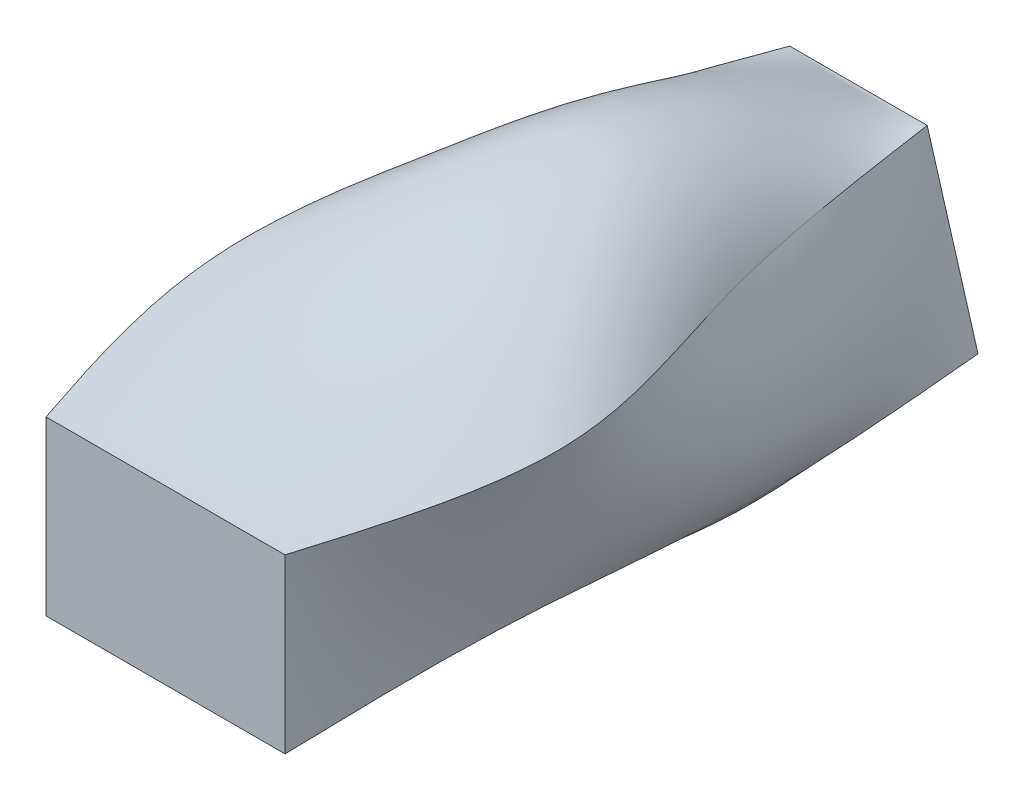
ISO-10303-21;
HEADER;
FILE_DESCRIPTION(('STEP AP214'),'2;1');
FILE_NAME('part.step','',(''),(''),'','','');
FILE_SCHEMA(('AUTOMOTIVE_DESIGN { 1 0 10303 214 1 1 1 1 }'));
ENDSEC;
DATA;
#1=APPLICATION_CONTEXT('core data for automotive mechanical design processes');
#2=APPLICATION_PROTOCOL_DEFINITION('international standard','automotive_design',2000,#1);
#3=PRODUCT_CONTEXT('',#1,'mechanical');
#4=PRODUCT('Part','Part','',(#3));
#5=PRODUCT_RELATED_PRODUCT_CATEGORY('part','',(#4));
#6=PRODUCT_DEFINITION_FORMATION('','',#4);
#7=PRODUCT_DEFINITION_CONTEXT('part definition',#1,'design');
#8=PRODUCT_DEFINITION('design','',#6,#7);
#9=PRODUCT_DEFINITION_SHAPE('','',#8);
#10=(LENGTH_UNIT() NAMED_UNIT(*) SI_UNIT(.MILLI.,.METRE.));
#11=(NAMED_UNIT(*) PLANE_ANGLE_UNIT() SI_UNIT($,.RADIAN.));
#12=(NAMED_UNIT(*) SI_UNIT($,.STERADIAN.) SOLID_ANGLE_UNIT());
#13=UNCERTAINTY_MEASURE_WITH_UNIT(LENGTH_MEASURE(1.E-05),#10,'distance_accuracy_value','');
#14=(GEOMETRIC_REPRESENTATION_CONTEXT(3) GLOBAL_UNCERTAINTY_ASSIGNED_CONTEXT((#13)) GLOBAL_UNIT_ASSIGNED_CONTEXT((#10,
#11,#12)) REPRESENTATION_CONTEXT('',''));
#15=CARTESIAN_POINT('',(0.,0.,0.));
#16=DIRECTION('',(0.,0.,1.));
#17=DIRECTION('',(1.,0.,0.));
#18=AXIS2_PLACEMENT_3D('',#15,#16,#17);
#19=CARTESIAN_POINT('',(-29.0014925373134,0.,-457.2));
#20=DIRECTION('',(0.,0.,1.));
#21=DIRECTION('',(1.,0.,0.));
#22=AXIS2_PLACEMENT_3D('',#19,#20,#21);
#23=PLANE('',#22);
#24=DIRECTION('',(1.,0.,0.));
#25=VECTOR('',#24,1.);
#26=CARTESIAN_POINT('',(-29.0014925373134,0.,-457.2));
#27=LINE('',#26,#25);
#28=CARTESIAN_POINT('',(-29.0014925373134,0.,-457.2));
#29=VERTEX_POINT('',#28);
#30=CARTESIAN_POINT('',(128.705970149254,0.,-457.2));
#31=VERTEX_POINT('',#30);
#32=EDGE_CURVE('E89',#29,#31,#27,.T.);
#33=ORIENTED_EDGE('',*,*,#32,.F.);
#34=DIRECTION('',(-0.282530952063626,-0.9592581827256,0.));
#35=VECTOR('',#34,1.);
#36=CARTESIAN_POINT('',(-29.0014925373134,0.,-457.2));
#37=LINE('',#36,#35);
#38=CARTESIAN_POINT('',(4.49587582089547,113.731343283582,-457.2));
#39=VERTEX_POINT('',#38);
#40=EDGE_CURVE('E98',#39,#29,#37,.T.);
#41=ORIENTED_EDGE('',*,*,#40,.F.);
#42=DIRECTION('',(-1.,0.,0.));
#43=VECTOR('',#42,1.);
#44=CARTESIAN_POINT('',(95.2086017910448,113.731343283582,-457.2));
#45=LINE('',#44,#43);
#46=CARTESIAN_POINT('',(95.2086017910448,113.731343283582,-457.2));
#47=VERTEX_POINT('',#46);
#48=EDGE_CURVE('E107',#47,#39,#45,.T.);
#49=ORIENTED_EDGE('',*,*,#48,.F.);
#50=DIRECTION('',(-0.282530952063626,0.9592581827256,0.));
#51=VECTOR('',#50,1.);
#52=CARTESIAN_POINT('',(128.705970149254,0.,-457.2));
#53=LINE('',#52,#51);
#54=EDGE_CURVE('E112',#31,#47,#53,.T.);
#55=ORIENTED_EDGE('',*,*,#54,.F.);
#56=EDGE_LOOP('',(#33,#41,#49,#55));
#57=FACE_BOUND('',#56,.T.);
#58=ADVANCED_FACE('F39',(#57),#23,.F.);
#59=CARTESIAN_POINT('',(-29.0014925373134,113.731343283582,0.));
#60=DIRECTION('',(0.,0.,-1.));
#61=DIRECTION('',(-1.,0.,0.));
#62=AXIS2_PLACEMENT_3D('',#59,#60,#61);
#63=PLANE('',#62);
#64=DIRECTION('',(0.,-1.,0.));
#65=VECTOR('',#64,1.);
#66=CARTESIAN_POINT('',(-29.0014925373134,0.,0.));
#67=LINE('',#66,#65);
#68=CARTESIAN_POINT('',(-29.0014925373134,113.731343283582,0.));
#69=VERTEX_POINT('',#68);
#70=CARTESIAN_POINT('',(-29.0014925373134,0.,0.));
#71=VERTEX_POINT('',#70);
#72=EDGE_CURVE('E94',#69,#71,#67,.T.);
#73=ORIENTED_EDGE('',*,*,#72,.T.);
#74=DIRECTION('',(1.,0.,0.));
#75=VECTOR('',#74,1.);
#76=CARTESIAN_POINT('',(-29.0014925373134,0.,0.));
#77=LINE('',#76,#75);
#78=CARTESIAN_POINT('',(128.705970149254,0.,0.));
#79=VERTEX_POINT('',#78);
#80=EDGE_CURVE('E12',#71,#79,#77,.T.);
#81=ORIENTED_EDGE('',*,*,#80,.T.);
#82=DIRECTION('',(0.,1.,0.));
#83=VECTOR('',#82,1.);
#84=CARTESIAN_POINT('',(128.705970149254,0.,0.));
#85=LINE('',#84,#83);
#86=CARTESIAN_POINT('',(128.705970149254,113.731343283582,0.));
#87=VERTEX_POINT('',#86);
#88=EDGE_CURVE('E51',#79,#87,#85,.T.);
#89=ORIENTED_EDGE('',*,*,#88,.T.);
#90=DIRECTION('',(-1.,0.,0.));
#91=VECTOR('',#90,1.);
#92=CARTESIAN_POINT('',(-29.0014925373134,113.731343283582,0.));
#93=LINE('',#92,#91);
#94=EDGE_CURVE('E59',#87,#69,#93,.T.);
#95=ORIENTED_EDGE('',*,*,#94,.T.);
#96=EDGE_LOOP('',(#73,#81,#89,#95));
#97=FACE_BOUND('',#96,.T.);
#98=ADVANCED_FACE('F41',(#97),#63,.F.);
#99=CARTESIAN_POINT('',(128.705970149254,0.,0.));
#100=CARTESIAN_POINT('',(128.573533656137,1.12549680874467,-50.8526330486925));
#101=CARTESIAN_POINT('',(128.307937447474,3.38263665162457,-152.835600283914));
#102=CARTESIAN_POINT('',(130.312412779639,-13.6521740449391,-305.312133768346));
#103=CARTESIAN_POINT('',(129.242558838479,-4.56013930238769,-406.465968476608));
#104=CARTESIAN_POINT('',(128.705970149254,0.,-457.2));
#105=CARTESIAN_POINT('',(102.421393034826,0.,0.));
#106=CARTESIAN_POINT('',(100.973307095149,4.0455657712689,-50.8526330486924));
#107=CARTESIAN_POINT('',(98.0692273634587,12.1587897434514,-152.835600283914));
#108=CARTESIAN_POINT('',(119.986543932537,-49.0723452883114,-305.312133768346));
#109=CARTESIAN_POINT('',(108.288556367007,-16.391289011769,-406.465968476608));
#110=CARTESIAN_POINT('',(102.421393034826,0.,-457.2));
#111=CARTESIAN_POINT('',(76.136815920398,0.,0.));
#112=CARTESIAN_POINT('',(74.8149784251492,5.48245660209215,-50.8526330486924));
#113=CARTESIAN_POINT('',(72.1640850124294,16.4773089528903,-152.835600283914));
#114=CARTESIAN_POINT('',(92.1705846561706,-66.5017005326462,-305.312133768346));
#115=CARTESIAN_POINT('',(81.49246248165,-22.2130934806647,-406.465968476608));
#116=CARTESIAN_POINT('',(76.136815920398,0.,-457.2));
#117=CARTESIAN_POINT('',(23.5676616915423,0.,0.));
#118=CARTESIAN_POINT('',(23.2090358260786,4.52133596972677,-50.8526330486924));
#119=CARTESIAN_POINT('',(22.4898256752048,13.5886984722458,-152.835600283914));
#120=CARTESIAN_POINT('',(27.9177608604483,-54.8433945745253,-305.312133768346));
#121=CARTESIAN_POINT('',(25.0206946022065,-18.3189518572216,-406.465968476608));
#122=CARTESIAN_POINT('',(23.5676616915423,0.,-457.2));
#123=CARTESIAN_POINT('',(-2.71691542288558,0.,0.));
#124=CARTESIAN_POINT('',(-2.69935412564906,2.17937689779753,-50.8526330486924));
#125=CARTESIAN_POINT('',(-2.66413563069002,6.55003205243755,-152.835600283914));
#126=CARTESIAN_POINT('',(-2.92993236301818,-26.4356437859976,-305.312133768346));
#127=CARTESIAN_POINT('',(-2.78806796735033,-8.8301114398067,-406.465968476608));
#128=CARTESIAN_POINT('',(-2.71691542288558,0.,-457.2));
#129=CARTESIAN_POINT('',(-29.0014925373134,0.,0.));
#130=CARTESIAN_POINT('',(-29.8752424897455,-1.31616819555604,-50.8526330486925));
#131=CARTESIAN_POINT('',(-31.6275138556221,-3.95569204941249,-152.835600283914));
#132=CARTESIAN_POINT('',(-18.4029849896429,15.9650006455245,-305.312133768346));
#133=CARTESIAN_POINT('',(-25.4613478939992,5.33267644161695,-406.465968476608));
#134=CARTESIAN_POINT('',(-29.0014925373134,0.,-457.2));
#135=B_SPLINE_SURFACE_WITH_KNOTS('',3,3,((#99,#100,#101,#102,#103,#104),(#105,#106,#107,#108,
#109,#110),(#111,#112,#113,#114,#115,#116),(#117,#118,#119,#120,#121,#122),(#123,#124,#125,#126,
#127,#128),(#129,#130,#131,#132,#133,#134)),.UNSPECIFIED.,.F.,.F.,.F.,(4,2,4),(4,1,1,4),(0.,0.5,
1.),(0.,0.331434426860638,0.664678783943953,1.),.UNSPECIFIED.);
#136=CARTESIAN_POINT('',(-29.0014925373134,0.,0.));
#137=CARTESIAN_POINT('',(-29.8752424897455,-1.31616819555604,-50.8526330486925));
#138=CARTESIAN_POINT('',(-31.6275138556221,-3.95569204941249,-152.835600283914));
#139=CARTESIAN_POINT('',(-18.4029849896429,15.9650006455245,-305.312133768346));
#140=CARTESIAN_POINT('',(-25.4613478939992,5.33267644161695,-406.465968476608));
#141=CARTESIAN_POINT('',(-29.0014925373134,0.,-457.2));
#142=B_SPLINE_CURVE_WITH_KNOTS('',3,(#136,#137,#138,#139,#140,#141),.UNSPECIFIED.,.F.,.F.,(4,1,
1,4),(0.,0.331434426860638,0.664678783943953,1.),.UNSPECIFIED.);
#143=EDGE_CURVE('E84',#71,#29,#142,.T.);
#144=CARTESIAN_POINT('',(128.705970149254,0.,0.));
#145=CARTESIAN_POINT('',(128.573533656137,1.12549680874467,-50.8526330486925));
#146=CARTESIAN_POINT('',(128.307937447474,3.38263665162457,-152.835600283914));
#147=CARTESIAN_POINT('',(130.312412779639,-13.6521740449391,-305.312133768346));
#148=CARTESIAN_POINT('',(129.242558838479,-4.56013930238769,-406.465968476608));
#149=CARTESIAN_POINT('',(128.705970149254,0.,-457.2));
#150=B_SPLINE_CURVE_WITH_KNOTS('',3,(#144,#145,#146,#147,#148,#149),.UNSPECIFIED.,.F.,.F.,(4,1,
1,4),(0.,0.331434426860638,0.664678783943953,1.),.UNSPECIFIED.);
#151=EDGE_CURVE('E95',#31,#79,#150,.F.);
#152=ORIENTED_EDGE('',*,*,#80,.F.);
#153=ORIENTED_EDGE('',*,*,#143,.T.);
#154=ORIENTED_EDGE('',*,*,#32,.T.);
#155=ORIENTED_EDGE('',*,*,#151,.T.);
#156=EDGE_LOOP('',(#152,#153,#154,#155));
#157=FACE_BOUND('',#156,.T.);
#158=ADVANCED_FACE('F86',(#157),#135,.T.);
#159=CARTESIAN_POINT('',(-29.0014925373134,0.,0.));
#160=CARTESIAN_POINT('',(-29.8752424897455,-1.31616819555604,-50.8526330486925));
#161=CARTESIAN_POINT('',(-31.6275138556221,-3.95569204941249,-152.835600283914));
#162=CARTESIAN_POINT('',(-18.4029849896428,15.9650006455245,-305.312133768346));
#163=CARTESIAN_POINT('',(-25.4613478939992,5.33267644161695,-406.465968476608));
#164=CARTESIAN_POINT('',(-29.0014925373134,0.,-457.2));
#165=CARTESIAN_POINT('',(-29.0014925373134,37.910447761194,0.));
#166=CARTESIAN_POINT('',(-31.8528655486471,37.1240988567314,-50.8526330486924));
#167=CARTESIAN_POINT('',(-37.5711826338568,35.5471068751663,-152.835600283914));
#168=CARTESIAN_POINT('',(-61.6235770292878,53.4704430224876,-305.312133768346));
#169=CARTESIAN_POINT('',(-32.4618574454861,43.107843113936,-406.465968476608));
#170=CARTESIAN_POINT('',(-17.8357030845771,37.910447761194,-457.2));
#171=CARTESIAN_POINT('',(-29.0014925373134,75.820895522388,0.));
#172=CARTESIAN_POINT('',(-37.1689381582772,74.2492919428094,-50.8526330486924));
#173=CARTESIAN_POINT('',(-53.5484310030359,71.0975024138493,-152.835600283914));
#174=CARTESIAN_POINT('',(-64.3490792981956,106.927613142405,-305.312133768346));
#175=CARTESIAN_POINT('',(-25.9360780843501,86.2112527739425,-406.465968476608));
#176=CARTESIAN_POINT('',(-6.66991363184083,75.820895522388,-457.2));
#177=CARTESIAN_POINT('',(-29.0014925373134,113.731343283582,0.));
#178=CARTESIAN_POINT('',(-46.0199214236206,113.600898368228,-50.8526330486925));
#179=CARTESIAN_POINT('',(-80.1497151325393,113.339296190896,-152.835600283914));
#180=CARTESIAN_POINT('',(-24.1964364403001,133.378591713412,-305.312133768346));
#181=CARTESIAN_POINT('',(-5.08801465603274,120.29397495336,-406.465968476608));
#182=CARTESIAN_POINT('',(4.49587582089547,113.731343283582,-457.2));
#183=B_SPLINE_SURFACE_WITH_KNOTS('',3,3,((#159,#160,#161,#162,#163,#164),(#165,#166,#167,#168,
#169,#170),(#171,#172,#173,#174,#175,#176),(#177,#178,#179,#180,#181,#182)),.UNSPECIFIED.,.F.,
.F.,.F.,(4,4),(4,1,1,4),(0.,1.),(0.,0.331434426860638,0.664678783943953,1.),.UNSPECIFIED.);
#184=CARTESIAN_POINT('',(-29.0014925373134,113.731343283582,0.));
#185=CARTESIAN_POINT('',(-46.0199214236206,113.600898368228,-50.8526330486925));
#186=CARTESIAN_POINT('',(-80.1497151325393,113.339296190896,-152.835600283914));
#187=CARTESIAN_POINT('',(-24.1964364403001,133.378591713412,-305.312133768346));
#188=CARTESIAN_POINT('',(-5.08801465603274,120.29397495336,-406.465968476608));
#189=CARTESIAN_POINT('',(4.49587582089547,113.731343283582,-457.2));
#190=B_SPLINE_CURVE_WITH_KNOTS('',3,(#184,#185,#186,#187,#188,#189),.UNSPECIFIED.,.F.,.F.,(4,1,
1,4),(0.,0.331434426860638,0.664678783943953,1.),.UNSPECIFIED.);
#191=EDGE_CURVE('E102',#69,#39,#190,.T.);
#192=ORIENTED_EDGE('',*,*,#72,.F.);
#193=ORIENTED_EDGE('',*,*,#191,.T.);
#194=ORIENTED_EDGE('',*,*,#40,.T.);
#195=ORIENTED_EDGE('',*,*,#143,.F.);
#196=EDGE_LOOP('',(#192,#193,#194,#195));
#197=FACE_BOUND('',#196,.T.);
#198=ADVANCED_FACE('F100',(#197),#183,.T.);
#199=CARTESIAN_POINT('',(128.705970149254,113.731343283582,0.));
#200=CARTESIAN_POINT('',(146.839784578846,115.89844080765,-50.8526330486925));
#201=CARTESIAN_POINT('',(183.206440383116,120.244470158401,-152.835600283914));
#202=CARTESIAN_POINT('',(110.371388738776,105.509610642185,-305.312133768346));
#203=CARTESIAN_POINT('',(100.273320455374,110.985095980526,-406.465968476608));
#204=CARTESIAN_POINT('',(95.2086017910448,113.731343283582,-457.2));
#205=CARTESIAN_POINT('',(128.705970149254,75.820895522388,0.));
#206=CARTESIAN_POINT('',(137.321646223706,77.40402311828,-50.8526330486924));
#207=CARTESIAN_POINT('',(154.600047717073,80.5789236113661,-152.835600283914));
#208=CARTESIAN_POINT('',(158.616562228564,68.6610105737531,-305.312133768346));
#209=CARTESIAN_POINT('',(123.824474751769,73.4293297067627,-406.465968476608));
#210=CARTESIAN_POINT('',(106.374391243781,75.820895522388,-457.2));
#211=CARTESIAN_POINT('',(128.705970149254,37.910447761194,0.));
#212=CARTESIAN_POINT('',(131.134353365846,40.3566795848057,-50.8526330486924));
#213=CARTESIAN_POINT('',(136.004380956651,45.2625018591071,-152.835600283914));
#214=CARTESIAN_POINT('',(166.458882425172,14.2595324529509,-305.312133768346));
#215=CARTESIAN_POINT('',(133.880149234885,30.0104995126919,-406.465968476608));
#216=CARTESIAN_POINT('',(117.540180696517,37.910447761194,-457.2));
#217=CARTESIAN_POINT('',(128.705970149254,0.,0.));
#218=CARTESIAN_POINT('',(128.573533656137,1.12549680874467,-50.8526330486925));
#219=CARTESIAN_POINT('',(128.307937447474,3.38263665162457,-152.835600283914));
#220=CARTESIAN_POINT('',(130.312412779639,-13.6521740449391,-305.312133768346));
#221=CARTESIAN_POINT('',(129.242558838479,-4.56013930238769,-406.465968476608));
#222=CARTESIAN_POINT('',(128.705970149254,0.,-457.2));
#223=B_SPLINE_SURFACE_WITH_KNOTS('',3,3,((#199,#200,#201,#202,#203,#204),(#205,#206,#207,#208,
#209,#210),(#211,#212,#213,#214,#215,#216),(#217,#218,#219,#220,#221,#222)),.UNSPECIFIED.,.F.,
.F.,.F.,(4,4),(4,1,1,4),(0.,1.),(0.,0.331434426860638,0.664678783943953,1.),.UNSPECIFIED.);
#224=CARTESIAN_POINT('',(128.705970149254,113.731343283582,0.));
#225=CARTESIAN_POINT('',(146.839784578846,115.89844080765,-50.8526330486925));
#226=CARTESIAN_POINT('',(183.206440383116,120.244470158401,-152.835600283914));
#227=CARTESIAN_POINT('',(110.371388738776,105.509610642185,-305.312133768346));
#228=CARTESIAN_POINT('',(100.273320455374,110.985095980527,-406.465968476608));
#229=CARTESIAN_POINT('',(95.2086017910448,113.731343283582,-457.2));
#230=B_SPLINE_CURVE_WITH_KNOTS('',3,(#224,#225,#226,#227,#228,#229),.UNSPECIFIED.,.F.,.F.,(4,1,
1,4),(0.,0.331434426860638,0.664678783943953,1.),.UNSPECIFIED.);
#231=EDGE_CURVE('E106',#87,#47,#230,.T.);
#232=ORIENTED_EDGE('',*,*,#88,.F.);
#233=ORIENTED_EDGE('',*,*,#151,.F.);
#234=ORIENTED_EDGE('',*,*,#54,.T.);
#235=ORIENTED_EDGE('',*,*,#231,.F.);
#236=EDGE_LOOP('',(#232,#233,#234,#235));
#237=FACE_BOUND('',#236,.T.);
#238=ADVANCED_FACE('F171',(#237),#223,.T.);
#239=CARTESIAN_POINT('',(-29.0014925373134,113.731343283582,0.));
#240=CARTESIAN_POINT('',(-46.0199214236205,113.600898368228,-50.8526330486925));
#241=CARTESIAN_POINT('',(-80.1497151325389,113.339296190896,-152.835600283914));
#242=CARTESIAN_POINT('',(-24.1964364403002,133.378591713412,-305.312133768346));
#243=CARTESIAN_POINT('',(-5.08801465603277,120.29397495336,-406.465968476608));
#244=CARTESIAN_POINT('',(4.49587582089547,113.731343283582,-457.2));
#245=CARTESIAN_POINT('',(-2.71691542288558,113.731343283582,0.));
#246=CARTESIAN_POINT('',(-13.3450939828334,117.649761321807,-50.8526330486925));
#247=CARTESIAN_POINT('',(-34.6594905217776,125.507995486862,-152.835600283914));
#248=CARTESIAN_POINT('',(-14.8783287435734,161.854658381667,-305.312133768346));
#249=CARTESIAN_POINT('',(8.09321283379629,129.805634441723,-406.465968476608));
#250=CARTESIAN_POINT('',(19.614663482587,113.731343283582,-457.2));
#251=CARTESIAN_POINT('',(23.5676616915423,113.731343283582,0.));
#252=CARTESIAN_POINT('',(18.8715435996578,119.70381755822,-50.8526330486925));
#253=CARTESIAN_POINT('',(9.4536623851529,131.681381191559,-152.835600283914));
#254=CARTESIAN_POINT('',(9.99102065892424,175.733346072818,-305.312133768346));
#255=CARTESIAN_POINT('',(26.4689117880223,134.441434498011,-406.465968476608));
#256=CARTESIAN_POINT('',(34.7334511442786,113.731343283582,-457.2));
#257=CARTESIAN_POINT('',(76.136815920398,113.731343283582,0.));
#258=CARTESIAN_POINT('',(82.6325470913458,120.599553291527,-50.8526330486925));
#259=CARTESIAN_POINT('',(95.6594819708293,134.373479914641,-152.835600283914));
#260=CARTESIAN_POINT('',(67.8843137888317,164.868153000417,-305.312133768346));
#261=CARTESIAN_POINT('',(65.9441312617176,130.812210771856,-406.465968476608));
#262=CARTESIAN_POINT('',(64.9710264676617,113.731343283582,-457.2));
#263=CARTESIAN_POINT('',(102.421393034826,113.731343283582,0.));
#264=CARTESIAN_POINT('',(114.597049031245,119.392134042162,-50.8526330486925));
#265=CARTESIAN_POINT('',(139.014851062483,130.744628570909,-152.835600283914));
#266=CARTESIAN_POINT('',(95.8120456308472,140.71983556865,-305.312133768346));
#267=CARTESIAN_POINT('',(85.3414001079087,122.746118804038,-406.465968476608));
#268=CARTESIAN_POINT('',(80.0898141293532,113.731343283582,-457.2));
#269=CARTESIAN_POINT('',(128.705970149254,113.731343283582,0.));
#270=CARTESIAN_POINT('',(146.839784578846,115.89844080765,-50.8526330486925));
#271=CARTESIAN_POINT('',(183.206440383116,120.244470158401,-152.835600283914));
#272=CARTESIAN_POINT('',(110.371388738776,105.509610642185,-305.312133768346));
#273=CARTESIAN_POINT('',(100.273320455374,110.985095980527,-406.465968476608));
#274=CARTESIAN_POINT('',(95.2086017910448,113.731343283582,-457.2));
#275=B_SPLINE_SURFACE_WITH_KNOTS('',3,3,((#239,#240,#241,#242,#243,#244),(#245,#246,#247,#248,
#249,#250),(#251,#252,#253,#254,#255,#256),(#257,#258,#259,#260,#261,#262),(#263,#264,#265,#266,
#267,#268),(#269,#270,#271,#272,#273,#274)),.UNSPECIFIED.,.F.,.F.,.F.,(4,2,4),(4,1,1,4),(0.,0.5,
1.),(0.,0.331434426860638,0.664678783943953,1.),.UNSPECIFIED.);
#276=ORIENTED_EDGE('',*,*,#94,.F.);
#277=ORIENTED_EDGE('',*,*,#231,.T.);
#278=ORIENTED_EDGE('',*,*,#48,.T.);
#279=ORIENTED_EDGE('',*,*,#191,.F.);
#280=EDGE_LOOP('',(#276,#277,#278,#279));
#281=FACE_BOUND('',#280,.T.);
#282=ADVANCED_FACE('F236',(#281),#275,.T.);
#283=CLOSED_SHELL('',(#58,#98,#158,#198,#238,#282));
#284=MANIFOLD_SOLID_BREP('B2',#283);
#285=ADVANCED_BREP_SHAPE_REPRESENTATION('',(#18,#284),#14);
#286=SHAPE_DEFINITION_REPRESENTATION(#9,#285);
ENDSEC;
END-ISO-10303-21;
